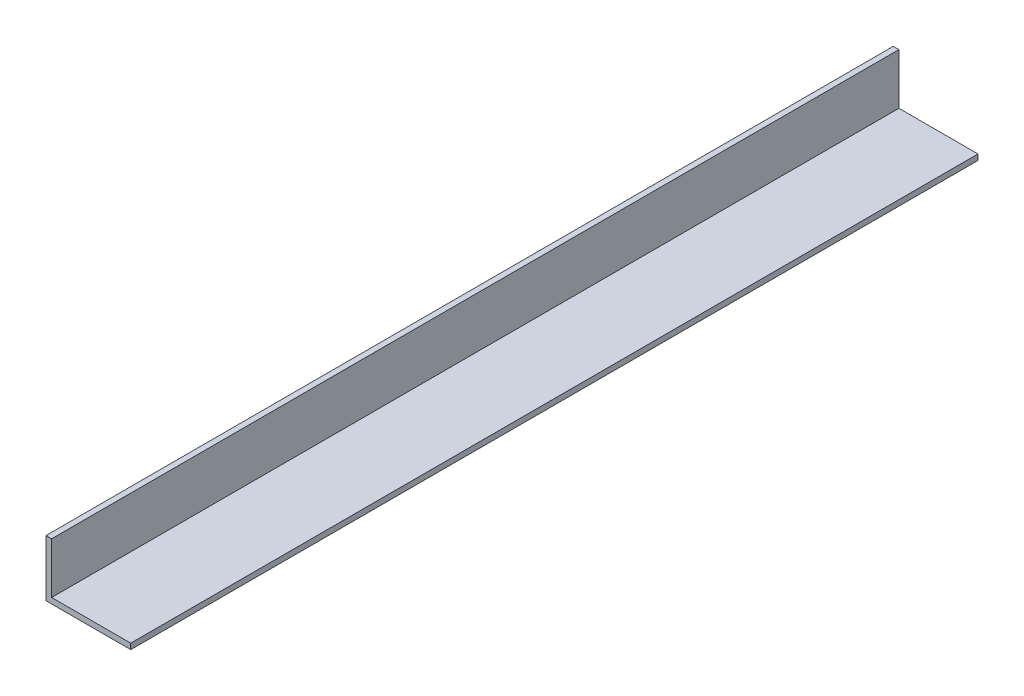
ISO-10303-21;
HEADER;
FILE_DESCRIPTION(('STEP AP214'),'2;1');
FILE_NAME('part.step','',(''),(''),'','','');
FILE_SCHEMA(('AUTOMOTIVE_DESIGN { 1 0 10303 214 1 1 1 1 }'));
ENDSEC;
DATA;
#1=APPLICATION_CONTEXT('core data for automotive mechanical design processes');
#2=APPLICATION_PROTOCOL_DEFINITION('international standard','automotive_design',2000,#1);
#3=PRODUCT_CONTEXT('',#1,'mechanical');
#4=PRODUCT('Part','Part','',(#3));
#5=PRODUCT_RELATED_PRODUCT_CATEGORY('part','',(#4));
#6=PRODUCT_DEFINITION_FORMATION('','',#4);
#7=PRODUCT_DEFINITION_CONTEXT('part definition',#1,'design');
#8=PRODUCT_DEFINITION('design','',#6,#7);
#9=PRODUCT_DEFINITION_SHAPE('','',#8);
#10=(LENGTH_UNIT() NAMED_UNIT(*) SI_UNIT(.MILLI.,.METRE.));
#11=(NAMED_UNIT(*) PLANE_ANGLE_UNIT() SI_UNIT($,.RADIAN.));
#12=(NAMED_UNIT(*) SI_UNIT($,.STERADIAN.) SOLID_ANGLE_UNIT());
#13=UNCERTAINTY_MEASURE_WITH_UNIT(LENGTH_MEASURE(1.E-05),#10,'distance_accuracy_value','');
#14=(GEOMETRIC_REPRESENTATION_CONTEXT(3) GLOBAL_UNCERTAINTY_ASSIGNED_CONTEXT((#13)) GLOBAL_UNIT_ASSIGNED_CONTEXT((#10,
#11,#12)) REPRESENTATION_CONTEXT('',''));
#15=CARTESIAN_POINT('',(0.,0.,0.));
#16=DIRECTION('',(0.,0.,1.));
#17=DIRECTION('',(1.,0.,0.));
#18=AXIS2_PLACEMENT_3D('',#15,#16,#17);
#19=CARTESIAN_POINT('',(28.,0.,150.));
#20=DIRECTION('',(0.,-1.,0.));
#21=DIRECTION('',(1.,0.,0.));
#22=AXIS2_PLACEMENT_3D('',#19,#20,#21);
#23=PLANE('',#22);
#24=DIRECTION('',(-1.,0.,0.));
#25=VECTOR('',#24,1.);
#26=CARTESIAN_POINT('',(28.,0.,-150.));
#27=LINE('',#26,#25);
#28=CARTESIAN_POINT('',(28.,0.,-150.));
#29=VERTEX_POINT('',#28);
#30=CARTESIAN_POINT('',(0.,0.,-150.));
#31=VERTEX_POINT('',#30);
#32=EDGE_CURVE('E120',#29,#31,#27,.T.);
#33=ORIENTED_EDGE('',*,*,#32,.T.);
#34=DIRECTION('',(0.,0.,-1.));
#35=VECTOR('',#34,1.);
#36=CARTESIAN_POINT('',(0.,0.,150.));
#37=LINE('',#36,#35);
#38=CARTESIAN_POINT('',(0.,0.,150.));
#39=VERTEX_POINT('',#38);
#40=EDGE_CURVE('E11',#39,#31,#37,.T.);
#41=ORIENTED_EDGE('',*,*,#40,.F.);
#42=DIRECTION('',(-1.,0.,0.));
#43=VECTOR('',#42,1.);
#44=CARTESIAN_POINT('',(28.,0.,150.));
#45=LINE('',#44,#43);
#46=CARTESIAN_POINT('',(28.,0.,150.));
#47=VERTEX_POINT('',#46);
#48=EDGE_CURVE('E130',#47,#39,#45,.T.);
#49=ORIENTED_EDGE('',*,*,#48,.F.);
#50=DIRECTION('',(0.,0.,-1.));
#51=VECTOR('',#50,1.);
#52=CARTESIAN_POINT('',(28.,0.,150.));
#53=LINE('',#52,#51);
#54=EDGE_CURVE('E116',#47,#29,#53,.T.);
#55=ORIENTED_EDGE('',*,*,#54,.T.);
#56=EDGE_LOOP('',(#33,#41,#49,#55));
#57=FACE_BOUND('',#56,.T.);
#58=ADVANCED_FACE('F36',(#57),#23,.F.);
#59=CARTESIAN_POINT('',(0.,0.,150.));
#60=DIRECTION('',(-1.,0.,0.));
#61=DIRECTION('',(0.,0.,1.));
#62=AXIS2_PLACEMENT_3D('',#59,#60,#61);
#63=PLANE('',#62);
#64=DIRECTION('',(0.,1.,0.));
#65=VECTOR('',#64,1.);
#66=CARTESIAN_POINT('',(0.,0.,-150.));
#67=LINE('',#66,#65);
#68=CARTESIAN_POINT('',(0.,18.,-150.));
#69=VERTEX_POINT('',#68);
#70=EDGE_CURVE('E123',#31,#69,#67,.T.);
#71=ORIENTED_EDGE('',*,*,#70,.T.);
#72=DIRECTION('',(0.,0.,-1.));
#73=VECTOR('',#72,1.);
#74=CARTESIAN_POINT('',(0.,18.,150.));
#75=LINE('',#74,#73);
#76=CARTESIAN_POINT('',(0.,18.,150.));
#77=VERTEX_POINT('',#76);
#78=EDGE_CURVE('E44',#77,#69,#75,.T.);
#79=ORIENTED_EDGE('',*,*,#78,.F.);
#80=DIRECTION('',(0.,1.,0.));
#81=VECTOR('',#80,1.);
#82=CARTESIAN_POINT('',(0.,0.,150.));
#83=LINE('',#82,#81);
#84=EDGE_CURVE('E89',#39,#77,#83,.T.);
#85=ORIENTED_EDGE('',*,*,#84,.F.);
#86=ORIENTED_EDGE('',*,*,#40,.T.);
#87=EDGE_LOOP('',(#71,#79,#85,#86));
#88=FACE_BOUND('',#87,.T.);
#89=ADVANCED_FACE('F154',(#88),#63,.F.);
#90=CARTESIAN_POINT('',(0.,18.,150.));
#91=DIRECTION('',(0.,-1.,0.));
#92=DIRECTION('',(0.,0.,-1.));
#93=AXIS2_PLACEMENT_3D('',#90,#91,#92);
#94=PLANE('',#93);
#95=DIRECTION('',(-1.,0.,0.));
#96=VECTOR('',#95,1.);
#97=CARTESIAN_POINT('',(0.,18.,-150.));
#98=LINE('',#97,#96);
#99=CARTESIAN_POINT('',(-2.,18.,-150.));
#100=VERTEX_POINT('',#99);
#101=EDGE_CURVE('E125',#69,#100,#98,.T.);
#102=ORIENTED_EDGE('',*,*,#101,.T.);
#103=DIRECTION('',(0.,0.,-1.));
#104=VECTOR('',#103,1.);
#105=CARTESIAN_POINT('',(-2.,18.,150.));
#106=LINE('',#105,#104);
#107=CARTESIAN_POINT('',(-2.,18.,150.));
#108=VERTEX_POINT('',#107);
#109=EDGE_CURVE('E111',#108,#100,#106,.T.);
#110=ORIENTED_EDGE('',*,*,#109,.F.);
#111=DIRECTION('',(-1.,0.,0.));
#112=VECTOR('',#111,1.);
#113=CARTESIAN_POINT('',(0.,18.,150.));
#114=LINE('',#113,#112);
#115=EDGE_CURVE('E102',#77,#108,#114,.T.);
#116=ORIENTED_EDGE('',*,*,#115,.F.);
#117=ORIENTED_EDGE('',*,*,#78,.T.);
#118=EDGE_LOOP('',(#102,#110,#116,#117));
#119=FACE_BOUND('',#118,.T.);
#120=ADVANCED_FACE('F136',(#119),#94,.F.);
#121=CARTESIAN_POINT('',(-2.,18.,150.));
#122=DIRECTION('',(1.,0.,0.));
#123=DIRECTION('',(0.,1.,0.));
#124=AXIS2_PLACEMENT_3D('',#121,#122,#123);
#125=PLANE('',#124);
#126=DIRECTION('',(0.,-1.,0.));
#127=VECTOR('',#126,1.);
#128=CARTESIAN_POINT('',(-2.,18.,-150.));
#129=LINE('',#128,#127);
#130=CARTESIAN_POINT('',(-1.99999999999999,-2.,-150.));
#131=VERTEX_POINT('',#130);
#132=EDGE_CURVE('E110',#100,#131,#129,.T.);
#133=ORIENTED_EDGE('',*,*,#132,.T.);
#134=DIRECTION('',(0.,0.,-1.));
#135=VECTOR('',#134,1.);
#136=CARTESIAN_POINT('',(-1.99999999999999,-2.,150.));
#137=LINE('',#136,#135);
#138=CARTESIAN_POINT('',(-1.99999999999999,-2.,150.));
#139=VERTEX_POINT('',#138);
#140=EDGE_CURVE('E107',#139,#131,#137,.T.);
#141=ORIENTED_EDGE('',*,*,#140,.F.);
#142=DIRECTION('',(0.,-1.,0.));
#143=VECTOR('',#142,1.);
#144=CARTESIAN_POINT('',(-2.,18.,150.));
#145=LINE('',#144,#143);
#146=EDGE_CURVE('E96',#108,#139,#145,.T.);
#147=ORIENTED_EDGE('',*,*,#146,.F.);
#148=ORIENTED_EDGE('',*,*,#109,.T.);
#149=EDGE_LOOP('',(#133,#141,#147,#148));
#150=FACE_BOUND('',#149,.T.);
#151=ADVANCED_FACE('F108',(#150),#125,.F.);
#152=CARTESIAN_POINT('',(-1.99999999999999,-2.,150.));
#153=DIRECTION('',(0.,1.,0.));
#154=DIRECTION('',(-1.,0.,0.));
#155=AXIS2_PLACEMENT_3D('',#152,#153,#154);
#156=PLANE('',#155);
#157=DIRECTION('',(1.,0.,0.));
#158=VECTOR('',#157,1.);
#159=CARTESIAN_POINT('',(-1.99999999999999,-2.,-150.));
#160=LINE('',#159,#158);
#161=CARTESIAN_POINT('',(28.,-2.,-150.));
#162=VERTEX_POINT('',#161);
#163=EDGE_CURVE('E75',#131,#162,#160,.T.);
#164=ORIENTED_EDGE('',*,*,#163,.T.);
#165=DIRECTION('',(0.,0.,-1.));
#166=VECTOR('',#165,1.);
#167=CARTESIAN_POINT('',(28.,-2.,150.));
#168=LINE('',#167,#166);
#169=CARTESIAN_POINT('',(28.,-2.,150.));
#170=VERTEX_POINT('',#169);
#171=EDGE_CURVE('E112',#170,#162,#168,.T.);
#172=ORIENTED_EDGE('',*,*,#171,.F.);
#173=DIRECTION('',(1.,0.,0.));
#174=VECTOR('',#173,1.);
#175=CARTESIAN_POINT('',(-1.99999999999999,-2.,150.));
#176=LINE('',#175,#174);
#177=EDGE_CURVE('E100',#139,#170,#176,.T.);
#178=ORIENTED_EDGE('',*,*,#177,.F.);
#179=ORIENTED_EDGE('',*,*,#140,.T.);
#180=EDGE_LOOP('',(#164,#172,#178,#179));
#181=FACE_BOUND('',#180,.T.);
#182=ADVANCED_FACE('F114',(#181),#156,.F.);
#183=CARTESIAN_POINT('',(28.,-2.,150.));
#184=DIRECTION('',(-1.,0.,0.));
#185=DIRECTION('',(0.,0.,1.));
#186=AXIS2_PLACEMENT_3D('',#183,#184,#185);
#187=PLANE('',#186);
#188=DIRECTION('',(0.,1.,0.));
#189=VECTOR('',#188,1.);
#190=CARTESIAN_POINT('',(28.,-2.,-150.));
#191=LINE('',#190,#189);
#192=EDGE_CURVE('E81',#162,#29,#191,.T.);
#193=ORIENTED_EDGE('',*,*,#192,.T.);
#194=ORIENTED_EDGE('',*,*,#54,.F.);
#195=DIRECTION('',(0.,1.,0.));
#196=VECTOR('',#195,1.);
#197=CARTESIAN_POINT('',(28.,-2.,150.));
#198=LINE('',#197,#196);
#199=EDGE_CURVE('E52',#170,#47,#198,.T.);
#200=ORIENTED_EDGE('',*,*,#199,.F.);
#201=ORIENTED_EDGE('',*,*,#171,.T.);
#202=EDGE_LOOP('',(#193,#194,#200,#201));
#203=FACE_BOUND('',#202,.T.);
#204=ADVANCED_FACE('F143',(#203),#187,.F.);
#205=CARTESIAN_POINT('',(0.,0.,150.));
#206=DIRECTION('',(0.,0.,-1.));
#207=DIRECTION('',(-1.,0.,0.));
#208=AXIS2_PLACEMENT_3D('',#205,#206,#207);
#209=PLANE('',#208);
#210=ORIENTED_EDGE('',*,*,#48,.T.);
#211=ORIENTED_EDGE('',*,*,#84,.T.);
#212=ORIENTED_EDGE('',*,*,#115,.T.);
#213=ORIENTED_EDGE('',*,*,#146,.T.);
#214=ORIENTED_EDGE('',*,*,#177,.T.);
#215=ORIENTED_EDGE('',*,*,#199,.T.);
#216=EDGE_LOOP('',(#210,#211,#212,#213,#214,#215));
#217=FACE_BOUND('',#216,.T.);
#218=ADVANCED_FACE('F98',(#217),#209,.F.);
#219=CARTESIAN_POINT('',(0.,0.,-150.));
#220=DIRECTION('',(0.,0.,-1.));
#221=DIRECTION('',(-1.,0.,0.));
#222=AXIS2_PLACEMENT_3D('',#219,#220,#221);
#223=PLANE('',#222);
#224=ORIENTED_EDGE('',*,*,#32,.F.);
#225=ORIENTED_EDGE('',*,*,#192,.F.);
#226=ORIENTED_EDGE('',*,*,#163,.F.);
#227=ORIENTED_EDGE('',*,*,#132,.F.);
#228=ORIENTED_EDGE('',*,*,#101,.F.);
#229=ORIENTED_EDGE('',*,*,#70,.F.);
#230=EDGE_LOOP('',(#224,#225,#226,#227,#228,#229));
#231=FACE_BOUND('',#230,.T.);
#232=ADVANCED_FACE('F139',(#231),#223,.T.);
#233=CLOSED_SHELL('',(#58,#89,#120,#151,#182,#204,#218,#232));
#234=MANIFOLD_SOLID_BREP('B2',#233);
#235=ADVANCED_BREP_SHAPE_REPRESENTATION('',(#18,#234),#14);
#236=SHAPE_DEFINITION_REPRESENTATION(#9,#235);
ENDSEC;
END-ISO-10303-21;
